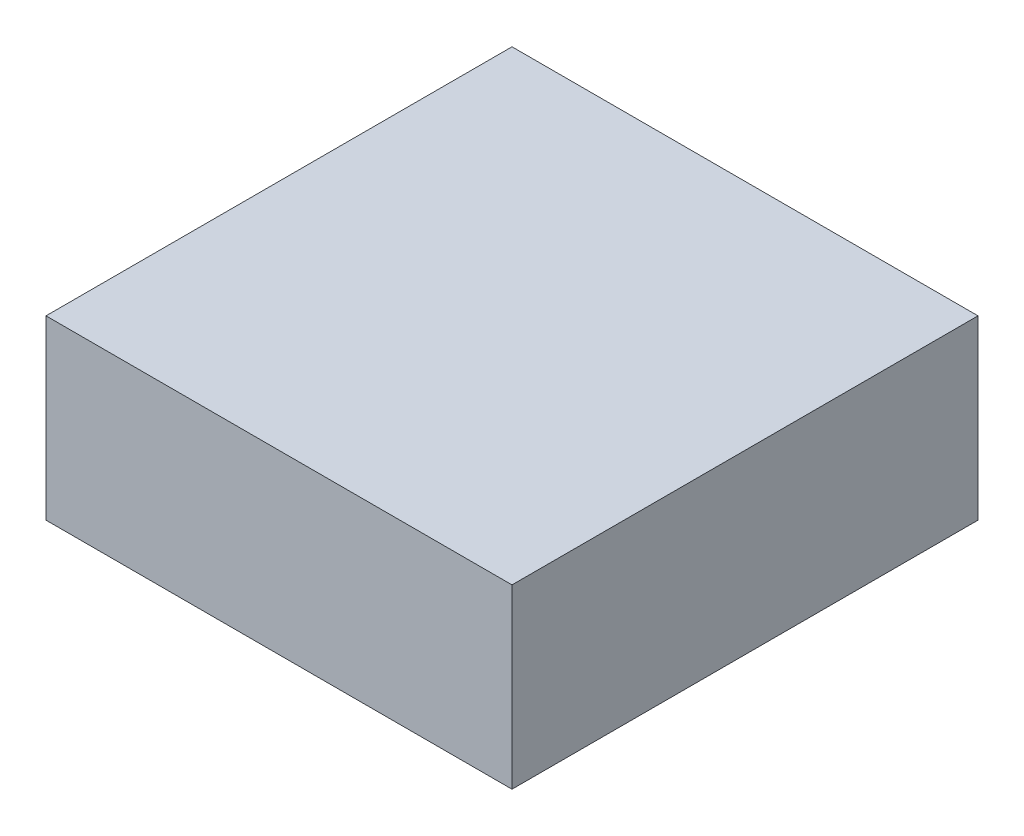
ISO-10303-21;
HEADER;
FILE_DESCRIPTION(('STEP AP214'),'2;1');
FILE_NAME('part.step','',(''),(''),'','','');
FILE_SCHEMA(('AUTOMOTIVE_DESIGN { 1 0 10303 214 1 1 1 1 }'));
ENDSEC;
DATA;
#1=APPLICATION_CONTEXT('core data for automotive mechanical design processes');
#2=APPLICATION_PROTOCOL_DEFINITION('international standard','automotive_design',2000,#1);
#3=PRODUCT_CONTEXT('',#1,'mechanical');
#4=PRODUCT('Part','Part','',(#3));
#5=PRODUCT_RELATED_PRODUCT_CATEGORY('part','',(#4));
#6=PRODUCT_DEFINITION_FORMATION('','',#4);
#7=PRODUCT_DEFINITION_CONTEXT('part definition',#1,'design');
#8=PRODUCT_DEFINITION('design','',#6,#7);
#9=PRODUCT_DEFINITION_SHAPE('','',#8);
#10=(LENGTH_UNIT() NAMED_UNIT(*) SI_UNIT(.MILLI.,.METRE.));
#11=(NAMED_UNIT(*) PLANE_ANGLE_UNIT() SI_UNIT($,.RADIAN.));
#12=(NAMED_UNIT(*) SI_UNIT($,.STERADIAN.) SOLID_ANGLE_UNIT());
#13=UNCERTAINTY_MEASURE_WITH_UNIT(LENGTH_MEASURE(1.E-05),#10,'distance_accuracy_value','');
#14=(GEOMETRIC_REPRESENTATION_CONTEXT(3) GLOBAL_UNCERTAINTY_ASSIGNED_CONTEXT((#13)) GLOBAL_UNIT_ASSIGNED_CONTEXT((#10,
#11,#12)) REPRESENTATION_CONTEXT('',''));
#15=CARTESIAN_POINT('',(0.,0.,0.));
#16=DIRECTION('',(0.,0.,1.));
#17=DIRECTION('',(1.,0.,0.));
#18=AXIS2_PLACEMENT_3D('',#15,#16,#17);
#19=CARTESIAN_POINT('',(-7.9,6.,7.9));
#20=DIRECTION('',(1.,0.,0.));
#21=DIRECTION('',(0.,0.,-1.));
#22=AXIS2_PLACEMENT_3D('',#19,#20,#21);
#23=PLANE('',#22);
#24=DIRECTION('',(0.,0.,1.));
#25=VECTOR('',#24,1.);
#26=CARTESIAN_POINT('',(-7.9,0.,7.9));
#27=LINE('',#26,#25);
#28=CARTESIAN_POINT('',(-7.9,0.,-7.9));
#29=VERTEX_POINT('',#28);
#30=CARTESIAN_POINT('',(-7.9,0.,7.9));
#31=VERTEX_POINT('',#30);
#32=EDGE_CURVE('E100',#29,#31,#27,.T.);
#33=ORIENTED_EDGE('',*,*,#32,.T.);
#34=DIRECTION('',(0.,-1.,0.));
#35=VECTOR('',#34,1.);
#36=CARTESIAN_POINT('',(-7.9,6.,7.9));
#37=LINE('',#36,#35);
#38=CARTESIAN_POINT('',(-7.9,6.,7.9));
#39=VERTEX_POINT('',#38);
#40=EDGE_CURVE('E11',#39,#31,#37,.T.);
#41=ORIENTED_EDGE('',*,*,#40,.F.);
#42=DIRECTION('',(0.,0.,1.));
#43=VECTOR('',#42,1.);
#44=CARTESIAN_POINT('',(-7.9,6.,7.9));
#45=LINE('',#44,#43);
#46=CARTESIAN_POINT('',(-7.9,6.,-7.9));
#47=VERTEX_POINT('',#46);
#48=EDGE_CURVE('E88',#47,#39,#45,.T.);
#49=ORIENTED_EDGE('',*,*,#48,.F.);
#50=DIRECTION('',(0.,-1.,0.));
#51=VECTOR('',#50,1.);
#52=CARTESIAN_POINT('',(-7.9,6.,-7.9));
#53=LINE('',#52,#51);
#54=EDGE_CURVE('E96',#47,#29,#53,.T.);
#55=ORIENTED_EDGE('',*,*,#54,.T.);
#56=EDGE_LOOP('',(#33,#41,#49,#55));
#57=FACE_BOUND('',#56,.T.);
#58=ADVANCED_FACE('F37',(#57),#23,.F.);
#59=CARTESIAN_POINT('',(7.9,6.,7.89999999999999));
#60=DIRECTION('',(0.,0.,-1.));
#61=DIRECTION('',(-1.,0.,0.));
#62=AXIS2_PLACEMENT_3D('',#59,#60,#61);
#63=PLANE('',#62);
#64=DIRECTION('',(1.,0.,0.));
#65=VECTOR('',#64,1.);
#66=CARTESIAN_POINT('',(7.9,0.,7.89999999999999));
#67=LINE('',#66,#65);
#68=CARTESIAN_POINT('',(7.9,0.,7.89999999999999));
#69=VERTEX_POINT('',#68);
#70=EDGE_CURVE('E92',#31,#69,#67,.T.);
#71=ORIENTED_EDGE('',*,*,#70,.T.);
#72=DIRECTION('',(0.,-1.,0.));
#73=VECTOR('',#72,1.);
#74=CARTESIAN_POINT('',(7.9,6.,7.89999999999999));
#75=LINE('',#74,#73);
#76=CARTESIAN_POINT('',(7.9,6.,7.89999999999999));
#77=VERTEX_POINT('',#76);
#78=EDGE_CURVE('E45',#77,#69,#75,.T.);
#79=ORIENTED_EDGE('',*,*,#78,.F.);
#80=DIRECTION('',(1.,0.,0.));
#81=VECTOR('',#80,1.);
#82=CARTESIAN_POINT('',(7.9,6.,7.89999999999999));
#83=LINE('',#82,#81);
#84=EDGE_CURVE('E83',#39,#77,#83,.T.);
#85=ORIENTED_EDGE('',*,*,#84,.F.);
#86=ORIENTED_EDGE('',*,*,#40,.T.);
#87=EDGE_LOOP('',(#71,#79,#85,#86));
#88=FACE_BOUND('',#87,.T.);
#89=ADVANCED_FACE('F91',(#88),#63,.F.);
#90=CARTESIAN_POINT('',(7.9,6.,7.89999999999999));
#91=DIRECTION('',(-1.,0.,0.));
#92=DIRECTION('',(0.,0.,1.));
#93=AXIS2_PLACEMENT_3D('',#90,#91,#92);
#94=PLANE('',#93);
#95=DIRECTION('',(0.,0.,-1.));
#96=VECTOR('',#95,1.);
#97=CARTESIAN_POINT('',(7.9,0.,7.89999999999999));
#98=LINE('',#97,#96);
#99=CARTESIAN_POINT('',(7.9,0.,-7.90000000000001));
#100=VERTEX_POINT('',#99);
#101=EDGE_CURVE('E70',#69,#100,#98,.T.);
#102=ORIENTED_EDGE('',*,*,#101,.T.);
#103=DIRECTION('',(0.,-1.,0.));
#104=VECTOR('',#103,1.);
#105=CARTESIAN_POINT('',(7.9,6.,-7.90000000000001));
#106=LINE('',#105,#104);
#107=CARTESIAN_POINT('',(7.9,6.,-7.90000000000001));
#108=VERTEX_POINT('',#107);
#109=EDGE_CURVE('E93',#108,#100,#106,.T.);
#110=ORIENTED_EDGE('',*,*,#109,.F.);
#111=DIRECTION('',(0.,0.,-1.));
#112=VECTOR('',#111,1.);
#113=CARTESIAN_POINT('',(7.9,6.,7.89999999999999));
#114=LINE('',#113,#112);
#115=EDGE_CURVE('E86',#77,#108,#114,.T.);
#116=ORIENTED_EDGE('',*,*,#115,.F.);
#117=ORIENTED_EDGE('',*,*,#78,.T.);
#118=EDGE_LOOP('',(#102,#110,#116,#117));
#119=FACE_BOUND('',#118,.T.);
#120=ADVANCED_FACE('F94',(#119),#94,.F.);
#121=CARTESIAN_POINT('',(7.9,6.,-7.90000000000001));
#122=DIRECTION('',(0.,0.,1.));
#123=DIRECTION('',(1.,0.,0.));
#124=AXIS2_PLACEMENT_3D('',#121,#122,#123);
#125=PLANE('',#124);
#126=DIRECTION('',(-1.,0.,0.));
#127=VECTOR('',#126,1.);
#128=CARTESIAN_POINT('',(7.9,0.,-7.90000000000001));
#129=LINE('',#128,#127);
#130=EDGE_CURVE('E76',#100,#29,#129,.T.);
#131=ORIENTED_EDGE('',*,*,#130,.T.);
#132=ORIENTED_EDGE('',*,*,#54,.F.);
#133=DIRECTION('',(-1.,0.,0.));
#134=VECTOR('',#133,1.);
#135=CARTESIAN_POINT('',(7.9,6.,-7.90000000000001));
#136=LINE('',#135,#134);
#137=EDGE_CURVE('E53',#108,#47,#136,.T.);
#138=ORIENTED_EDGE('',*,*,#137,.F.);
#139=ORIENTED_EDGE('',*,*,#109,.T.);
#140=EDGE_LOOP('',(#131,#132,#138,#139));
#141=FACE_BOUND('',#140,.T.);
#142=ADVANCED_FACE('F107',(#141),#125,.F.);
#143=CARTESIAN_POINT('',(-7.9,6.,-7.9));
#144=DIRECTION('',(0.,1.,0.));
#145=DIRECTION('',(0.,0.,1.));
#146=AXIS2_PLACEMENT_3D('',#143,#144,#145);
#147=PLANE('',#146);
#148=ORIENTED_EDGE('',*,*,#48,.T.);
#149=ORIENTED_EDGE('',*,*,#84,.T.);
#150=ORIENTED_EDGE('',*,*,#115,.T.);
#151=ORIENTED_EDGE('',*,*,#137,.T.);
#152=EDGE_LOOP('',(#148,#149,#150,#151));
#153=FACE_BOUND('',#152,.T.);
#154=ADVANCED_FACE('F84',(#153),#147,.T.);
#155=CARTESIAN_POINT('',(-7.9,0.,-7.9));
#156=DIRECTION('',(0.,1.,0.));
#157=DIRECTION('',(0.,0.,1.));
#158=AXIS2_PLACEMENT_3D('',#155,#156,#157);
#159=PLANE('',#158);
#160=ORIENTED_EDGE('',*,*,#32,.F.);
#161=ORIENTED_EDGE('',*,*,#130,.F.);
#162=ORIENTED_EDGE('',*,*,#101,.F.);
#163=ORIENTED_EDGE('',*,*,#70,.F.);
#164=EDGE_LOOP('',(#160,#161,#162,#163));
#165=FACE_BOUND('',#164,.T.);
#166=ADVANCED_FACE('F110',(#165),#159,.F.);
#167=CLOSED_SHELL('',(#58,#89,#120,#142,#154,#166));
#168=MANIFOLD_SOLID_BREP('B2',#167);
#169=ADVANCED_BREP_SHAPE_REPRESENTATION('',(#18,#168),#14);
#170=SHAPE_DEFINITION_REPRESENTATION(#9,#169);
ENDSEC;
END-ISO-10303-21;
